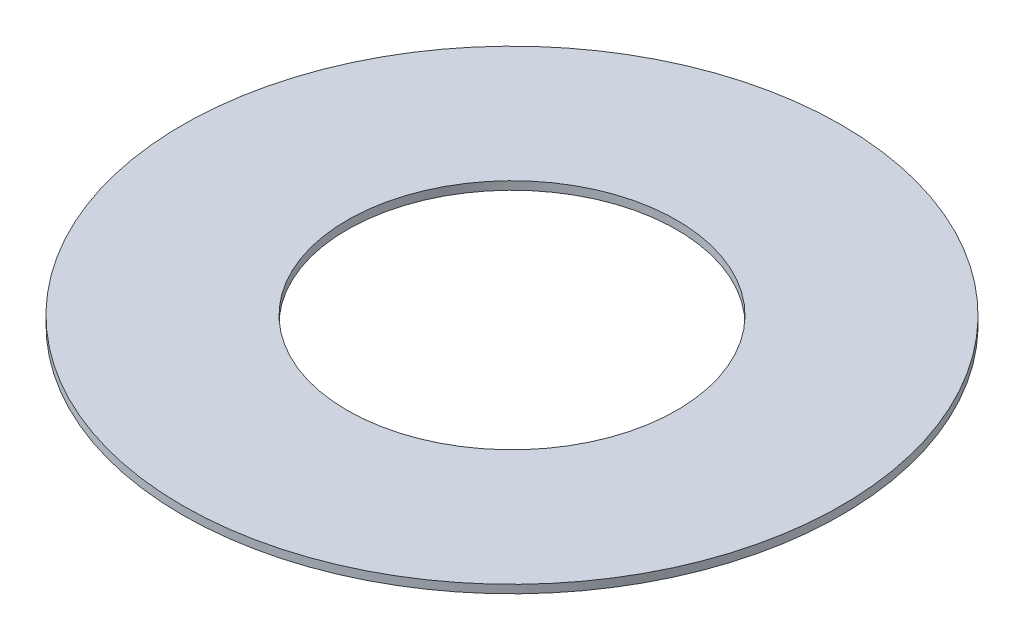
ISO-10303-21;
HEADER;
FILE_DESCRIPTION(('STEP AP214'),'2;1');
FILE_NAME('part.step','',(''),(''),'','','');
FILE_SCHEMA(('AUTOMOTIVE_DESIGN { 1 0 10303 214 1 1 1 1 }'));
ENDSEC;
DATA;
#1=APPLICATION_CONTEXT('core data for automotive mechanical design processes');
#2=APPLICATION_PROTOCOL_DEFINITION('international standard','automotive_design',2000,#1);
#3=PRODUCT_CONTEXT('',#1,'mechanical');
#4=PRODUCT('Part','Part','',(#3));
#5=PRODUCT_RELATED_PRODUCT_CATEGORY('part','',(#4));
#6=PRODUCT_DEFINITION_FORMATION('','',#4);
#7=PRODUCT_DEFINITION_CONTEXT('part definition',#1,'design');
#8=PRODUCT_DEFINITION('design','',#6,#7);
#9=PRODUCT_DEFINITION_SHAPE('','',#8);
#10=(LENGTH_UNIT() NAMED_UNIT(*) SI_UNIT(.MILLI.,.METRE.));
#11=(NAMED_UNIT(*) PLANE_ANGLE_UNIT() SI_UNIT($,.RADIAN.));
#12=(NAMED_UNIT(*) SI_UNIT($,.STERADIAN.) SOLID_ANGLE_UNIT());
#13=UNCERTAINTY_MEASURE_WITH_UNIT(LENGTH_MEASURE(1.E-05),#10,'distance_accuracy_value','');
#14=(GEOMETRIC_REPRESENTATION_CONTEXT(3) GLOBAL_UNCERTAINTY_ASSIGNED_CONTEXT((#13)) GLOBAL_UNIT_ASSIGNED_CONTEXT((#10,
#11,#12)) REPRESENTATION_CONTEXT('',''));
#15=CARTESIAN_POINT('',(0.,0.,0.));
#16=DIRECTION('',(0.,0.,1.));
#17=DIRECTION('',(1.,0.,0.));
#18=AXIS2_PLACEMENT_3D('',#15,#16,#17);
#19=CARTESIAN_POINT('',(0.,2.54,0.));
#20=DIRECTION('',(0.,1.,0.));
#21=DIRECTION('',(0.,0.,1.));
#22=AXIS2_PLACEMENT_3D('',#19,#20,#21);
#23=PLANE('',#22);
#24=CARTESIAN_POINT('',(0.,2.54,0.));
#25=DIRECTION('',(0.,1.,0.));
#26=DIRECTION('',(0.,0.,1.));
#27=AXIS2_PLACEMENT_3D('',#24,#25,#26);
#28=CIRCLE('',#27,101.6);
#29=CARTESIAN_POINT('',(0.,2.54,101.6));
#30=VERTEX_POINT('',#29);
#31=EDGE_CURVE('E10',#30,#30,#28,.T.);
#32=ORIENTED_EDGE('',*,*,#31,.T.);
#33=EDGE_LOOP('',(#32));
#34=FACE_BOUND('',#33,.T.);
#35=CARTESIAN_POINT('',(0.,2.54,0.));
#36=DIRECTION('',(0.,1.,0.));
#37=DIRECTION('',(0.,0.,1.));
#38=AXIS2_PLACEMENT_3D('',#35,#36,#37);
#39=CIRCLE('',#38,50.8);
#40=CARTESIAN_POINT('',(0.,2.54,50.8));
#41=VERTEX_POINT('',#40);
#42=EDGE_CURVE('E44',#41,#41,#39,.T.);
#43=ORIENTED_EDGE('',*,*,#42,.F.);
#44=EDGE_LOOP('',(#43));
#45=FACE_BOUND('',#44,.T.);
#46=ADVANCED_FACE('F33',(#34,#45),#23,.T.);
#47=CARTESIAN_POINT('',(0.,0.,0.));
#48=DIRECTION('',(0.,1.,0.));
#49=DIRECTION('',(0.,0.,1.));
#50=AXIS2_PLACEMENT_3D('',#47,#48,#49);
#51=PLANE('',#50);
#52=CARTESIAN_POINT('',(0.,0.,0.));
#53=DIRECTION('',(0.,1.,0.));
#54=DIRECTION('',(0.,0.,1.));
#55=AXIS2_PLACEMENT_3D('',#52,#53,#54);
#56=CIRCLE('',#55,101.6);
#57=CARTESIAN_POINT('',(0.,0.,101.6));
#58=VERTEX_POINT('',#57);
#59=EDGE_CURVE('E37',#58,#58,#56,.T.);
#60=ORIENTED_EDGE('',*,*,#59,.F.);
#61=EDGE_LOOP('',(#60));
#62=FACE_BOUND('',#61,.T.);
#63=CARTESIAN_POINT('',(0.,0.,0.));
#64=DIRECTION('',(0.,1.,0.));
#65=DIRECTION('',(0.,0.,1.));
#66=AXIS2_PLACEMENT_3D('',#63,#64,#65);
#67=CIRCLE('',#66,50.8);
#68=CARTESIAN_POINT('',(0.,0.,50.8));
#69=VERTEX_POINT('',#68);
#70=EDGE_CURVE('E46',#69,#69,#67,.T.);
#71=ORIENTED_EDGE('',*,*,#70,.T.);
#72=EDGE_LOOP('',(#71));
#73=FACE_BOUND('',#72,.T.);
#74=ADVANCED_FACE('F56',(#62,#73),#51,.F.);
#75=CARTESIAN_POINT('',(0.,2.54,0.));
#76=DIRECTION('',(0.,-1.,0.));
#77=DIRECTION('',(0.,0.,-1.));
#78=AXIS2_PLACEMENT_3D('',#75,#76,#77);
#79=CYLINDRICAL_SURFACE('',#78,101.6);
#80=ORIENTED_EDGE('',*,*,#31,.F.);
#81=EDGE_LOOP('',(#80));
#82=FACE_BOUND('',#81,.T.);
#83=ORIENTED_EDGE('',*,*,#59,.T.);
#84=EDGE_LOOP('',(#83));
#85=FACE_BOUND('',#84,.T.);
#86=ADVANCED_FACE('F35',(#82,#85),#79,.T.);
#87=CARTESIAN_POINT('',(0.,2.54,0.));
#88=DIRECTION('',(0.,-1.,0.));
#89=DIRECTION('',(0.,0.,-1.));
#90=AXIS2_PLACEMENT_3D('',#87,#88,#89);
#91=CYLINDRICAL_SURFACE('',#90,50.8);
#92=ORIENTED_EDGE('',*,*,#42,.T.);
#93=EDGE_LOOP('',(#92));
#94=FACE_BOUND('',#93,.T.);
#95=ORIENTED_EDGE('',*,*,#70,.F.);
#96=EDGE_LOOP('',(#95));
#97=FACE_BOUND('',#96,.T.);
#98=ADVANCED_FACE('F52',(#94,#97),#91,.F.);
#99=CLOSED_SHELL('',(#46,#74,#86,#98));
#100=MANIFOLD_SOLID_BREP('B2',#99);
#101=ADVANCED_BREP_SHAPE_REPRESENTATION('',(#18,#100),#14);
#102=SHAPE_DEFINITION_REPRESENTATION(#9,#101);
ENDSEC;
END-ISO-10303-21;
